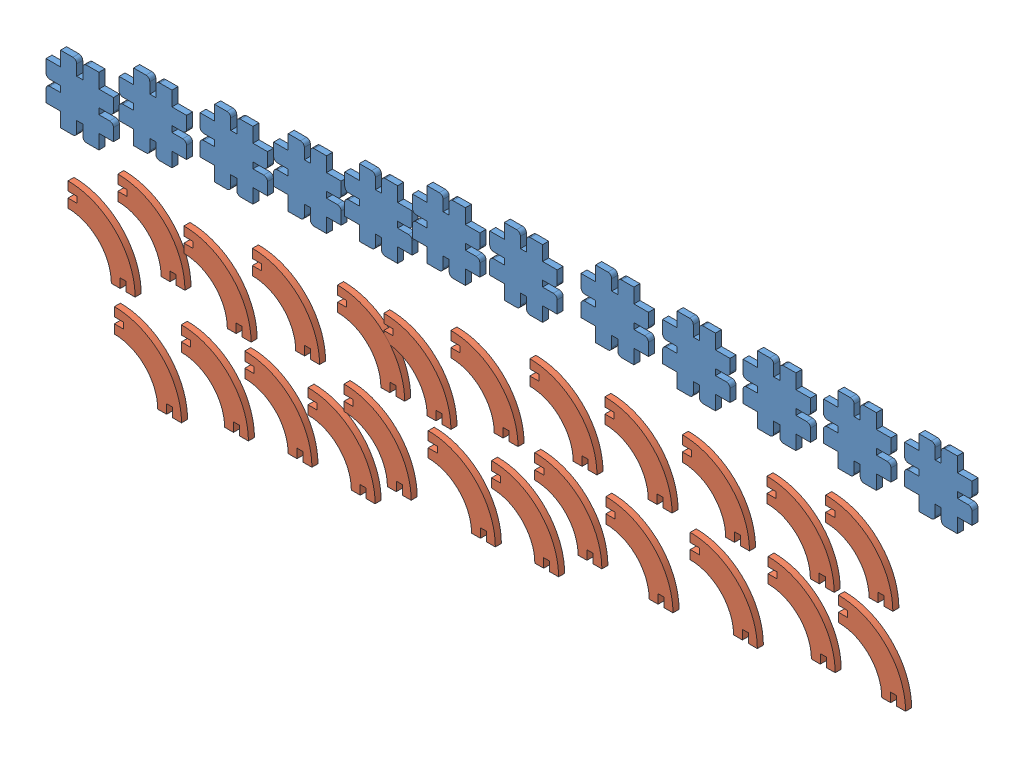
SolidWorks assembly face assemble.SLDASM, configuration Default (file format 9000). Lengths in mm.
Overall size (613.51 238.09 4).
36 component instances, 2 part files, 41 mates.
Components (placement in the parent):
- Part4-1: Part4.SLDPRT [Default] at (-44.3565 99.2406 59.0333) size (44.7 44.62 4)
- Part3-2: Part3.SLDPRT [Default] at (-178.1281 -21.9456 59.0333) size (44.48 44.48 4)
- Part4-2: Part4.SLDPRT [Default] at (-93.1225 91.7167 59.0333) size (44.7 44.62 4)
- Part3-3: Part3.SLDPRT [Default] at (-145.1185 -1.5284 59.0333) size (44.48 44.48 4)
- Part4-3: Part4.SLDPRT [Default] at (-146.751 85.7409 59.0333) size (44.7 44.62 4)
- Part3-4: Part3.SLDPRT [Default] at (-101.292 -9.3997 59.0333) size (44.48 44.48 4)
- Part4-4: Part4.SLDPRT [Default] at (-195.1635 71.7634 59.0333) size (44.7 44.62 4)
- Part3-5: Part3.SLDPRT [Default] at (-55.942 0.4278 59.0333) size (44.48 44.48 4)
- Part4-5: Part4.SLDPRT [Default] at (159.3045 125.725 59.0333) size (44.7 44.62 4)
- Part3-6: Part3.SLDPRT [Default] at (4.7725 -47.0867 59.0333) size (44.48 44.48 4)
- Part4-6: Part4.SLDPRT [Default] at (98.8205 119.8419 59.0333) size (44.7 44.62 4)
- Part3-7: Part3.SLDPRT [Default] at (-19.1207 -61.0475 59.0333) size (44.48 44.48 4)
- Part4-7: Part4.SLDPRT [Default] at (47.6122 115.4251 59.0333) size (44.7 44.62 4)
- Part3-8: Part3.SLDPRT [Default] at (-60.9921 -61.029 59.0333) size (44.48 44.48 4)
- Part4-8: Part4.SLDPRT [Default] at (2.7615 105.6382 59.0333) size (44.7 44.62 4)
- Part3-9: Part3.SLDPRT [Default] at (-103.069 -66.9791 59.0333) size (44.48 44.48 4)
- Part3-10: Part3.SLDPRT [Default] at (-147.4009 -78.7533 59.0333) size (44.48 44.48 4)
- Part3-11: Part3.SLDPRT [Default] at (0.4652 7.5855 59.0333) size (44.48 44.48 4)
- Part3-12: Part3.SLDPRT [Default] at (31.1154 6.7294 59.0333) size (44.48 44.48 4)
- Part4-9: Part4.SLDPRT [Default] at (213.3421 126.3287 59.0333) size (44.7 44.62 4)
- Part3-13: Part3.SLDPRT [Default] at (60.5373 -45.9572 59.0333) size (44.48 44.48 4)
- Part4-10: Part4.SLDPRT [Default] at (266.6516 130.1617 59.0333) size (44.7 44.62 4)
- Part3-14: Part3.SLDPRT [Default] at (75.5601 19.088 59.0333) size (44.48 44.48 4)
- Part3-15: Part3.SLDPRT [Default] at (102.4558 -42.1703 59.0333) size (44.48 44.48 4)
- Part4-11: Part4.SLDPRT [Default] at (319.9612 133.9947 59.0333) size (44.7 44.62 4)
- Part3-16: Part3.SLDPRT [Default] at (131.1222 -23.2925 59.0333) size (44.48 44.48 4)
- Part4-12: Part4.SLDPRT [Default] at (373.6401 136.0155 59.0333) size (44.7 44.62 4)
- Part3-17: Part3.SLDPRT [Default] at (127.8624 28.9867 59.0333) size (44.48 44.48 4)
- Part3-18: Part3.SLDPRT [Default] at (178.2308 -24.9466 59.0333) size (44.48 44.48 4)
- Part3-19: Part3.SLDPRT [Default] at (177.6066 31.9892 59.0333) size (44.48 44.48 4)
- Part3-20: Part3.SLDPRT [Default] at (234.1312 -17.4954 59.0333) size (44.48 44.48 4)
- Part3-21: Part3.SLDPRT [Default] at (228.903 35.9047 59.0333) size (44.48 44.48 4)
- Part3-22: Part3.SLDPRT [Default] at (285.7027 -5.5649 59.0333) size (44.48 44.48 4)
- Part3-23: Part3.SLDPRT [Default] at (285.0163 40.169 59.0333) size (44.48 44.48 4)
- Part3-24: Part3.SLDPRT [Default] at (332.3416 -4.3874 59.0333) size (44.48 44.48 4)
- Part3-25: Part3.SLDPRT [Default] at (323.9077 48.7675 59.0333) size (44.48 44.48 4)
Mates (geometry in assembly coordinates):
- Coincident1: coincident aligned: plane of Part4-4 through (-195.1635 71.7634 63.0333) normal (0 0 1); plane of Part4-2 through (-93.1225 91.7167 63.0333) normal (0 0 1)
- Coincident2: coincident aligned: plane of Part4-5 through (159.3045 125.725 59.0333) normal (0 0 -1); plane of Part4-6 through (98.8205 119.8419 59.0333) normal (0 0 -1)
- Coincident3: coincident aligned: plane of Part4-6 through (98.8205 119.8419 59.0333) normal (0 0 -1); plane of Part4-7 through (47.6122 115.4251 59.0333) normal (0 0 -1)
- Coincident4: coincident aligned: plane of Part4-7 through (47.6122 115.4251 59.0333) normal (0 0 -1); plane of Part4-8 through (2.7615 105.6382 59.0333) normal (0 0 -1)
- Coincident5: coincident aligned: plane of Part4-1 through (-44.3565 99.2406 59.0333) normal (0 0 -1); plane of Part4-8 through (2.7615 105.6382 59.0333) normal (0 0 -1)
- Coincident6: coincident aligned: plane of Part4-1 through (-44.3565 99.2406 59.0333) normal (0 0 -1); plane of Part4-2 through (-93.1225 91.7167 59.0333) normal (0 0 -1)
- Coincident7: coincident aligned: plane of Part4-2 through (-93.1225 91.7167 59.0333) normal (0 0 -1); plane of Part4-3 through (-146.751 85.7409 59.0333) normal (0 0 -1)
- Coincident8: coincident aligned: plane of Part4-5 through (159.3045 125.725 59.0333) normal (0 0 -1); plane of Part3-11 through (-37.0686 7.5855 59.0333) normal (0 0 -1)
- Coincident9: coincident aligned: plane of Part3-5 through (-93.4758 0.4278 59.0333) normal (0 0 -1); plane of Part4-6 through (98.8205 119.8419 59.0333) normal (0 0 -1)
- Coincident10: coincident aligned: plane of Part3-4 through (-138.8258 -9.3997 59.0333) normal (0 0 -1); plane of Part3-5 through (-93.4758 0.4278 59.0333) normal (0 0 -1)
- Coincident11: coincident aligned: circle of Part3-3; plane of Part3-4 through (-138.8258 -9.3997 59.0333) normal (0 0 -1)
- Coincident12: coincident aligned: plane of Part3-2 through (-215.662 -21.9456 59.0333) normal (0 0 -1); plane of Part3-3 through (-182.6523 -1.5284 59.0333) normal (0 0 -1)
- Coincident13: coincident aligned: plane of Part3-6 through (-32.7613 -47.0867 59.0333) normal (0 0 -1); plane of Part3-11 through (-37.0686 7.5855 59.0333) normal (0 0 -1)
- Coincident14: coincident aligned: circle of Part3-5; plane of Part3-7 through (-56.6545 -61.0475 59.0333) normal (0 0 -1)
- Coincident15: coincident aligned: plane of Part3-4 through (-138.8258 -9.3997 59.0333) normal (0 0 -1); plane of Part3-8 through (-98.5259 -61.029 59.0333) normal (0 0 -1)
- Coincident16: coincident aligned: plane of Part3-3 through (-182.6523 -1.5284 59.0333) normal (0 0 -1); circle of Part3-9
- Coincident17: coincident aligned: plane of Part3-2 through (-215.662 -21.9456 59.0333) normal (0 0 -1); plane of Part3-10 through (-184.9347 -78.7533 59.0333) normal (0 0 -1)
- Coincident18: coincident aligned: plane of Part4-5 through (159.3045 125.725 59.0333) normal (0 0 -1); plane of Part4-9 through (213.3421 126.3287 59.0333) normal (0 0 -1)
- Coincident19: coincident aligned: plane of Part4-9 through (213.3421 126.3287 59.0333) normal (0 0 -1); plane of Part4-10 through (266.6516 130.1617 59.0333) normal (0 0 -1)
- Coincident20: coincident aligned: plane of Part4-10 through (266.6516 130.1617 59.0333) normal (0 0 -1); plane of Part4-11 through (319.9612 133.9947 59.0333) normal (0 0 -1)
- Coincident21: coincident: plane of Part4-11 through (319.9612 133.9947 59.0333) normal (0 0 -1); point of Part4-12
- Coincident22: coincident aligned: plane of Part4-12 through (373.6401 136.0155 59.0333) normal (0 0 -1); plane of Part3-25 through (286.3739 48.7675 59.0333) normal (0 0 -1)
- Coincident23: coincident aligned: plane of Part3-23 through (247.4825 40.169 59.0333) normal (0 0 -1); plane of Part3-25 through (286.3739 48.7675 59.0333) normal (0 0 -1)
- Coincident24: coincident aligned: plane of Part3-21 through (191.3692 35.9047 59.0333) normal (0 0 -1); plane of Part3-23 through (247.4825 40.169 59.0333) normal (0 0 -1)
- Coincident25: coincident aligned: plane of Part3-19 through (140.0728 31.9892 59.0333) normal (0 0 -1); plane of Part3-21 through (191.3692 35.9047 59.0333) normal (0 0 -1)
- Coincident26: coincident aligned: plane of Part3-17 through (90.3286 28.9867 59.0333) normal (0 0 -1); plane of Part3-19 through (140.0728 31.9892 59.0333) normal (0 0 -1)
- Coincident27: coincident aligned: plane of Part3-14 through (38.0262 19.088 59.0333) normal (0 0 -1); plane of Part3-17 through (90.3286 28.9867 59.0333) normal (0 0 -1)
- Coincident28: coincident aligned: plane of Part3-12 through (-6.4185 6.7294 59.0333) normal (0 0 -1); plane of Part3-14 through (38.0262 19.088 59.0333) normal (0 0 -1)
- Coincident29: coincident aligned: plane of Part3-11 through (-37.0686 7.5855 59.0333) normal (0 0 -1); plane of Part3-12 through (-6.4185 6.7294 59.0333) normal (0 0 -1)
- Coincident30: coincident aligned: plane of Part3-5 through (-93.4758 0.4278 59.0333) normal (0 0 -1); plane of Part3-11 through (-37.0686 7.5855 59.0333) normal (0 0 -1)
- Coincident31: coincident aligned: plane of Part3-4 through (-138.8258 -9.3997 59.0333) normal (0 0 -1); plane of Part3-5 through (-93.4758 0.4278 59.0333) normal (0 0 -1)
- Coincident32: coincident aligned: plane of Part3-9 through (-140.6028 -66.9791 59.0333) normal (0 0 -1); plane of Part3-10 through (-184.9347 -78.7533 59.0333) normal (0 0 -1)
- Coincident33: coincident aligned: plane of Part3-8 through (-98.5259 -61.029 59.0333) normal (0 0 -1); plane of Part3-9 through (-140.6028 -66.9791 59.0333) normal (0 0 -1)
- Coincident34: coincident aligned: plane of Part3-6 through (-32.7613 -47.0867 59.0333) normal (0 0 -1); plane of Part3-7 through (-56.6545 -61.0475 59.0333) normal (0 0 -1)
- Coincident35: coincident aligned: plane of Part3-6 through (-32.7613 -47.0867 59.0333) normal (0 0 -1); plane of Part3-13 through (23.0035 -45.9572 59.0333) normal (0 0 -1)
- Coincident36: coincident aligned: plane of Part3-13 through (23.0035 -45.9572 59.0333) normal (0 0 -1); plane of Part3-15 through (64.9219 -42.1703 59.0333) normal (0 0 -1)
- Coincident37: coincident aligned: plane of Part3-15 through (64.9219 -42.1703 59.0333) normal (0 0 -1); plane of Part3-16 through (93.5884 -23.2925 59.0333) normal (0 0 -1)
- Coincident38: coincident anti-aligned: circle of Part3-16; plane of Part3-18 through (140.697 -24.9466 59.0333) normal (0 0 -1)
- Coincident39: coincident aligned: plane of Part3-18 through (140.697 -24.9466 59.0333) normal (0 0 -1); plane of Part3-20 through (196.5974 -17.4954 59.0333) normal (0 0 -1)
- Coincident40: coincident aligned: plane of Part3-20 through (196.5974 -17.4954 59.0333) normal (0 0 -1); plane of Part3-22 through (248.1689 -5.5649 59.0333) normal (0 0 -1)
- Coincident41: coincident aligned: plane of Part3-22 through (248.1689 -5.5649 59.0333) normal (0 0 -1); plane of Part3-24 through (294.8078 -4.3874 59.0333) normal (0 0 -1)
